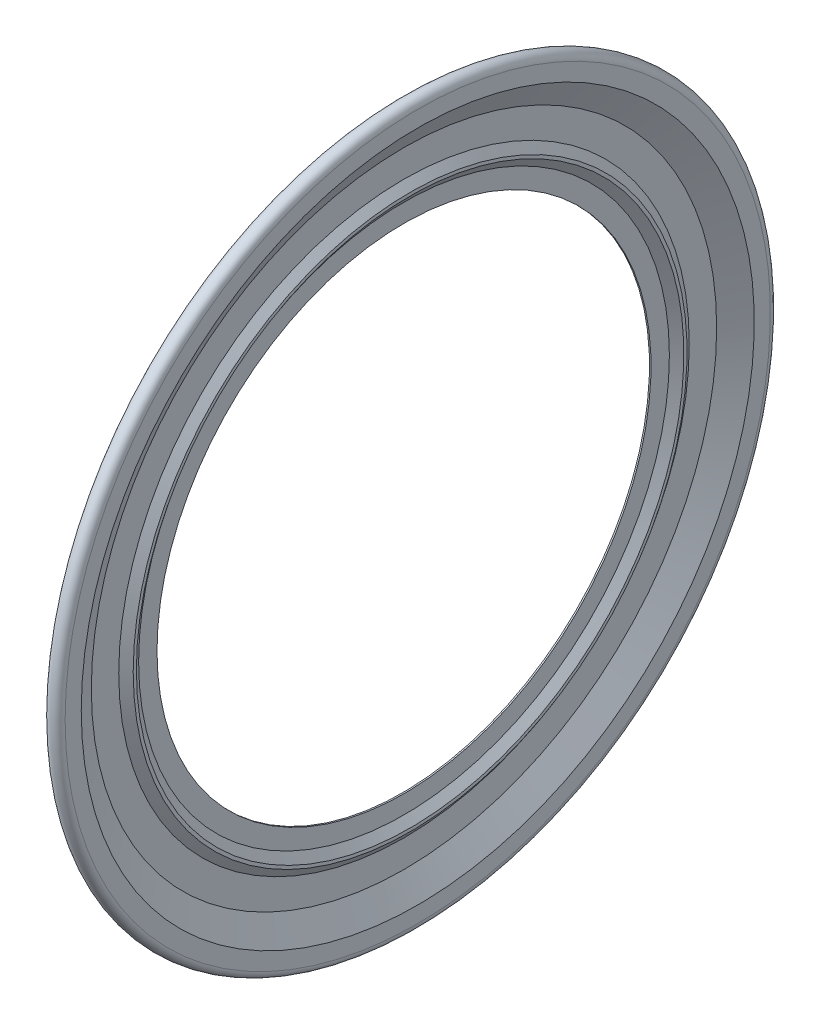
ISO-10303-21;
HEADER;
FILE_DESCRIPTION(('STEP AP214'),'2;1');
FILE_NAME('part.step','',(''),(''),'','','');
FILE_SCHEMA(('AUTOMOTIVE_DESIGN { 1 0 10303 214 1 1 1 1 }'));
ENDSEC;
DATA;
#1=APPLICATION_CONTEXT('core data for automotive mechanical design processes');
#2=APPLICATION_PROTOCOL_DEFINITION('international standard','automotive_design',2000,#1);
#3=PRODUCT_CONTEXT('',#1,'mechanical');
#4=PRODUCT('Part','Part','',(#3));
#5=PRODUCT_RELATED_PRODUCT_CATEGORY('part','',(#4));
#6=PRODUCT_DEFINITION_FORMATION('','',#4);
#7=PRODUCT_DEFINITION_CONTEXT('part definition',#1,'design');
#8=PRODUCT_DEFINITION('design','',#6,#7);
#9=PRODUCT_DEFINITION_SHAPE('','',#8);
#10=(LENGTH_UNIT() NAMED_UNIT(*) SI_UNIT(.MILLI.,.METRE.));
#11=(NAMED_UNIT(*) PLANE_ANGLE_UNIT() SI_UNIT($,.RADIAN.));
#12=(NAMED_UNIT(*) SI_UNIT($,.STERADIAN.) SOLID_ANGLE_UNIT());
#13=UNCERTAINTY_MEASURE_WITH_UNIT(LENGTH_MEASURE(1.E-05),#10,'distance_accuracy_value','');
#14=(GEOMETRIC_REPRESENTATION_CONTEXT(3) GLOBAL_UNCERTAINTY_ASSIGNED_CONTEXT((#13)) GLOBAL_UNIT_ASSIGNED_CONTEXT((#10,
#11,#12)) REPRESENTATION_CONTEXT('',''));
#15=CARTESIAN_POINT('',(0.,0.,0.));
#16=DIRECTION('',(0.,0.,1.));
#17=DIRECTION('',(1.,0.,0.));
#18=AXIS2_PLACEMENT_3D('',#15,#16,#17);
#19=CARTESIAN_POINT('',(0.25,0.,0.));
#20=DIRECTION('',(1.,0.,0.));
#21=DIRECTION('',(0.,0.,-1.));
#22=AXIS2_PLACEMENT_3D('',#19,#20,#21);
#23=CONICAL_SURFACE('',#22,20.4694194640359,1.0471975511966);
#24=CARTESIAN_POINT('',(1.15,0.,0.));
#25=DIRECTION('',(-1.,0.,0.));
#26=DIRECTION('',(0.,0.,1.));
#27=AXIS2_PLACEMENT_3D('',#24,#25,#26);
#28=CIRCLE('',#27,22.028265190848);
#29=CARTESIAN_POINT('',(1.15,0.,22.028265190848));
#30=VERTEX_POINT('',#29);
#31=EDGE_CURVE('E10',#30,#30,#28,.T.);
#32=ORIENTED_EDGE('',*,*,#31,.T.);
#33=EDGE_LOOP('',(#32));
#34=FACE_BOUND('',#33,.T.);
#35=CARTESIAN_POINT('',(0.25,0.,0.));
#36=DIRECTION('',(-1.,0.,0.));
#37=DIRECTION('',(0.,0.,1.));
#38=AXIS2_PLACEMENT_3D('',#35,#36,#37);
#39=CIRCLE('',#38,20.4694194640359);
#40=CARTESIAN_POINT('',(0.25,0.,20.4694194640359));
#41=VERTEX_POINT('',#40);
#42=EDGE_CURVE('E92',#41,#41,#39,.T.);
#43=ORIENTED_EDGE('',*,*,#42,.F.);
#44=EDGE_LOOP('',(#43));
#45=FACE_BOUND('',#44,.T.);
#46=ADVANCED_FACE('F28',(#34,#45),#23,.T.);
#47=CARTESIAN_POINT('',(1.15,22.028265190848,0.));
#48=DIRECTION('',(-1.,0.,0.));
#49=DIRECTION('',(0.,0.,1.));
#50=AXIS2_PLACEMENT_3D('',#47,#48,#49);
#51=PLANE('',#50);
#52=CARTESIAN_POINT('',(1.15,0.,0.));
#53=DIRECTION('',(-1.,0.,0.));
#54=DIRECTION('',(0.,0.,1.));
#55=AXIS2_PLACEMENT_3D('',#52,#53,#54);
#56=CIRCLE('',#55,23.0556622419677);
#57=CARTESIAN_POINT('',(1.15,0.,23.0556622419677));
#58=VERTEX_POINT('',#57);
#59=EDGE_CURVE('E34',#58,#58,#56,.T.);
#60=ORIENTED_EDGE('',*,*,#59,.T.);
#61=EDGE_LOOP('',(#60));
#62=FACE_BOUND('',#61,.T.);
#63=ORIENTED_EDGE('',*,*,#31,.F.);
#64=EDGE_LOOP('',(#63));
#65=FACE_BOUND('',#64,.T.);
#66=ADVANCED_FACE('F100',(#62,#65),#51,.T.);
#67=CARTESIAN_POINT('',(0.75,0.,0.));
#68=DIRECTION('',(-1.,0.,0.));
#69=DIRECTION('',(0.,0.,1.));
#70=AXIS2_PLACEMENT_3D('',#67,#68,#69);
#71=TOROIDAL_SURFACE('',#70,23.0556622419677,0.4);
#72=CARTESIAN_POINT('',(0.35,0.,0.));
#73=DIRECTION('',(-1.,0.,0.));
#74=DIRECTION('',(0.,0.,1.));
#75=AXIS2_PLACEMENT_3D('',#72,#73,#74);
#76=CIRCLE('',#75,23.0556622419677);
#77=CARTESIAN_POINT('',(0.35,0.,23.0556622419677));
#78=VERTEX_POINT('',#77);
#79=EDGE_CURVE('E38',#78,#78,#76,.T.);
#80=ORIENTED_EDGE('',*,*,#79,.T.);
#81=EDGE_LOOP('',(#80));
#82=FACE_BOUND('',#81,.T.);
#83=ORIENTED_EDGE('',*,*,#59,.F.);
#84=EDGE_LOOP('',(#83));
#85=FACE_BOUND('',#84,.T.);
#86=ADVANCED_FACE('F104',(#82,#85),#71,.F.);
#87=CARTESIAN_POINT('',(0.35,23.0556622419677,0.));
#88=DIRECTION('',(1.,0.,0.));
#89=DIRECTION('',(0.,0.,-1.));
#90=AXIS2_PLACEMENT_3D('',#87,#88,#89);
#91=PLANE('',#90);
#92=CARTESIAN_POINT('',(0.35,0.,0.));
#93=DIRECTION('',(-1.,0.,0.));
#94=DIRECTION('',(0.,0.,1.));
#95=AXIS2_PLACEMENT_3D('',#92,#93,#94);
#96=CIRCLE('',#95,21.7039165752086);
#97=CARTESIAN_POINT('',(0.35,0.,21.7039165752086));
#98=VERTEX_POINT('',#97);
#99=EDGE_CURVE('E42',#98,#98,#96,.T.);
#100=ORIENTED_EDGE('',*,*,#99,.T.);
#101=EDGE_LOOP('',(#100));
#102=FACE_BOUND('',#101,.T.);
#103=ORIENTED_EDGE('',*,*,#79,.F.);
#104=EDGE_LOOP('',(#103));
#105=FACE_BOUND('',#104,.T.);
#106=ADVANCED_FACE('F108',(#102,#105),#91,.T.);
#107=CARTESIAN_POINT('',(0.,0.,0.));
#108=DIRECTION('',(-1.,0.,0.));
#109=DIRECTION('',(0.,0.,1.));
#110=AXIS2_PLACEMENT_3D('',#107,#108,#109);
#111=CYLINDRICAL_SURFACE('',#110,21.7039165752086);
#112=ORIENTED_EDGE('',*,*,#99,.F.);
#113=EDGE_LOOP('',(#112));
#114=FACE_BOUND('',#113,.T.);
#115=CARTESIAN_POINT('',(0.25,0.,0.));
#116=DIRECTION('',(-1.,0.,0.));
#117=DIRECTION('',(0.,0.,1.));
#118=AXIS2_PLACEMENT_3D('',#115,#116,#117);
#119=CIRCLE('',#118,21.7039165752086);
#120=CARTESIAN_POINT('',(0.25,0.,21.7039165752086));
#121=VERTEX_POINT('',#120);
#122=EDGE_CURVE('E47',#121,#121,#119,.T.);
#123=ORIENTED_EDGE('',*,*,#122,.T.);
#124=EDGE_LOOP('',(#123));
#125=FACE_BOUND('',#124,.T.);
#126=ADVANCED_FACE('F115',(#114,#125),#111,.F.);
#127=CARTESIAN_POINT('',(0.25,23.0556622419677,0.));
#128=DIRECTION('',(1.,0.,0.));
#129=DIRECTION('',(0.,0.,-1.));
#130=AXIS2_PLACEMENT_3D('',#127,#128,#129);
#131=PLANE('',#130);
#132=ORIENTED_EDGE('',*,*,#122,.F.);
#133=EDGE_LOOP('',(#132));
#134=FACE_BOUND('',#133,.T.);
#135=CARTESIAN_POINT('',(0.25,0.,0.));
#136=DIRECTION('',(-1.,0.,0.));
#137=DIRECTION('',(0.,0.,1.));
#138=AXIS2_PLACEMENT_3D('',#135,#136,#137);
#139=CIRCLE('',#138,23.0556622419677);
#140=CARTESIAN_POINT('',(0.25,0.,23.0556622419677));
#141=VERTEX_POINT('',#140);
#142=EDGE_CURVE('E50',#141,#141,#139,.T.);
#143=ORIENTED_EDGE('',*,*,#142,.T.);
#144=EDGE_LOOP('',(#143));
#145=FACE_BOUND('',#144,.T.);
#146=ADVANCED_FACE('F119',(#134,#145),#131,.F.);
#147=CARTESIAN_POINT('',(0.75,0.,0.));
#148=DIRECTION('',(-1.,0.,0.));
#149=DIRECTION('',(0.,0.,1.));
#150=AXIS2_PLACEMENT_3D('',#147,#148,#149);
#151=TOROIDAL_SURFACE('',#150,23.0556622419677,0.5);
#152=ORIENTED_EDGE('',*,*,#142,.F.);
#153=EDGE_LOOP('',(#152));
#154=FACE_BOUND('',#153,.T.);
#155=CARTESIAN_POINT('',(1.25,0.,0.));
#156=DIRECTION('',(-1.,0.,0.));
#157=DIRECTION('',(0.,0.,1.));
#158=AXIS2_PLACEMENT_3D('',#155,#156,#157);
#159=CIRCLE('',#158,23.0556622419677);
#160=CARTESIAN_POINT('',(1.25,0.,23.0556622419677));
#161=VERTEX_POINT('',#160);
#162=EDGE_CURVE('E53',#161,#161,#159,.T.);
#163=ORIENTED_EDGE('',*,*,#162,.T.);
#164=EDGE_LOOP('',(#163));
#165=FACE_BOUND('',#164,.T.);
#166=ADVANCED_FACE('F123',(#154,#165),#151,.T.);
#167=CARTESIAN_POINT('',(1.25,23.0556622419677,0.));
#168=DIRECTION('',(1.,0.,0.));
#169=DIRECTION('',(0.,0.,-1.));
#170=AXIS2_PLACEMENT_3D('',#167,#168,#169);
#171=PLANE('',#170);
#172=CARTESIAN_POINT('',(1.25,0.,0.));
#173=DIRECTION('',(-1.,0.,0.));
#174=DIRECTION('',(0.,0.,1.));
#175=AXIS2_PLACEMENT_3D('',#172,#173,#174);
#176=CIRCLE('',#175,22.0014702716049);
#177=CARTESIAN_POINT('',(1.25,0.,22.0014702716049));
#178=VERTEX_POINT('',#177);
#179=EDGE_CURVE('E56',#178,#178,#176,.T.);
#180=ORIENTED_EDGE('',*,*,#179,.T.);
#181=EDGE_LOOP('',(#180));
#182=FACE_BOUND('',#181,.T.);
#183=ORIENTED_EDGE('',*,*,#162,.F.);
#184=EDGE_LOOP('',(#183));
#185=FACE_BOUND('',#184,.T.);
#186=ADVANCED_FACE('F127',(#182,#185),#171,.T.);
#187=CARTESIAN_POINT('',(1.25,0.,0.));
#188=DIRECTION('',(1.,0.,0.));
#189=DIRECTION('',(0.,0.,-1.));
#190=AXIS2_PLACEMENT_3D('',#187,#188,#189);
#191=CONICAL_SURFACE('',#190,22.0014702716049,1.0471975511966);
#192=CARTESIAN_POINT('',(0.35,0.,0.));
#193=DIRECTION('',(-1.,0.,0.));
#194=DIRECTION('',(0.,0.,1.));
#195=AXIS2_PLACEMENT_3D('',#192,#193,#194);
#196=CIRCLE('',#195,20.4426245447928);
#197=CARTESIAN_POINT('',(0.35,0.,20.4426245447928));
#198=VERTEX_POINT('',#197);
#199=EDGE_CURVE('E59',#198,#198,#196,.T.);
#200=ORIENTED_EDGE('',*,*,#199,.T.);
#201=EDGE_LOOP('',(#200));
#202=FACE_BOUND('',#201,.T.);
#203=ORIENTED_EDGE('',*,*,#179,.F.);
#204=EDGE_LOOP('',(#203));
#205=FACE_BOUND('',#204,.T.);
#206=ADVANCED_FACE('F131',(#202,#205),#191,.F.);
#207=CARTESIAN_POINT('',(0.35,20.4426245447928,0.));
#208=DIRECTION('',(1.,0.,0.));
#209=DIRECTION('',(0.,0.,-1.));
#210=AXIS2_PLACEMENT_3D('',#207,#208,#209);
#211=PLANE('',#210);
#212=CARTESIAN_POINT('',(0.35,0.,0.));
#213=DIRECTION('',(-1.,0.,0.));
#214=DIRECTION('',(0.,0.,1.));
#215=AXIS2_PLACEMENT_3D('',#212,#213,#214);
#216=CIRCLE('',#215,18.6503967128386);
#217=CARTESIAN_POINT('',(0.35,0.,18.6503967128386));
#218=VERTEX_POINT('',#217);
#219=EDGE_CURVE('E62',#218,#218,#216,.T.);
#220=ORIENTED_EDGE('',*,*,#219,.T.);
#221=EDGE_LOOP('',(#220));
#222=FACE_BOUND('',#221,.T.);
#223=ORIENTED_EDGE('',*,*,#199,.F.);
#224=EDGE_LOOP('',(#223));
#225=FACE_BOUND('',#224,.T.);
#226=ADVANCED_FACE('F135',(#222,#225),#211,.T.);
#227=CARTESIAN_POINT('',(0.35,0.,0.));
#228=DIRECTION('',(-1.,0.,0.));
#229=DIRECTION('',(0.,0.,1.));
#230=AXIS2_PLACEMENT_3D('',#227,#228,#229);
#231=CONICAL_SURFACE('',#230,18.6503967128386,0.938302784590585);
#232=CARTESIAN_POINT('',(0.75,0.,0.));
#233=DIRECTION('',(-1.,0.,0.));
#234=DIRECTION('',(0.,0.,1.));
#235=AXIS2_PLACEMENT_3D('',#232,#233,#234);
#236=CIRCLE('',#235,18.1046500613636);
#237=CARTESIAN_POINT('',(0.75,0.,18.1046500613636));
#238=VERTEX_POINT('',#237);
#239=EDGE_CURVE('E65',#238,#238,#236,.T.);
#240=ORIENTED_EDGE('',*,*,#239,.T.);
#241=EDGE_LOOP('',(#240));
#242=FACE_BOUND('',#241,.T.);
#243=ORIENTED_EDGE('',*,*,#219,.F.);
#244=EDGE_LOOP('',(#243));
#245=FACE_BOUND('',#244,.T.);
#246=ADVANCED_FACE('F139',(#242,#245),#231,.T.);
#247=CARTESIAN_POINT('',(0.75,18.1046500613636,0.));
#248=DIRECTION('',(1.,0.,0.));
#249=DIRECTION('',(0.,0.,-1.));
#250=AXIS2_PLACEMENT_3D('',#247,#248,#249);
#251=PLANE('',#250);
#252=CARTESIAN_POINT('',(0.75,0.,0.));
#253=DIRECTION('',(-1.,0.,0.));
#254=DIRECTION('',(0.,0.,1.));
#255=AXIS2_PLACEMENT_3D('',#252,#253,#254);
#256=CIRCLE('',#255,17.8962004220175);
#257=CARTESIAN_POINT('',(0.75,0.,17.8962004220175));
#258=VERTEX_POINT('',#257);
#259=EDGE_CURVE('E68',#258,#258,#256,.T.);
#260=ORIENTED_EDGE('',*,*,#259,.T.);
#261=EDGE_LOOP('',(#260));
#262=FACE_BOUND('',#261,.T.);
#263=ORIENTED_EDGE('',*,*,#239,.F.);
#264=EDGE_LOOP('',(#263));
#265=FACE_BOUND('',#264,.T.);
#266=ADVANCED_FACE('F143',(#262,#265),#251,.T.);
#267=CARTESIAN_POINT('',(0.75,0.,0.));
#268=DIRECTION('',(1.,0.,0.));
#269=DIRECTION('',(0.,0.,-1.));
#270=AXIS2_PLACEMENT_3D('',#267,#268,#269);
#271=CONICAL_SURFACE('',#270,17.8962004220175,0.938302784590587);
#272=CARTESIAN_POINT('',(0.35,0.,0.));
#273=DIRECTION('',(-1.,0.,0.));
#274=DIRECTION('',(0.,0.,1.));
#275=AXIS2_PLACEMENT_3D('',#272,#273,#274);
#276=CIRCLE('',#275,17.3504537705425);
#277=CARTESIAN_POINT('',(0.35,0.,17.3504537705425));
#278=VERTEX_POINT('',#277);
#279=EDGE_CURVE('E71',#278,#278,#276,.T.);
#280=ORIENTED_EDGE('',*,*,#279,.T.);
#281=EDGE_LOOP('',(#280));
#282=FACE_BOUND('',#281,.T.);
#283=ORIENTED_EDGE('',*,*,#259,.F.);
#284=EDGE_LOOP('',(#283));
#285=FACE_BOUND('',#284,.T.);
#286=ADVANCED_FACE('F147',(#282,#285),#271,.F.);
#287=CARTESIAN_POINT('',(0.35,17.3504537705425,0.));
#288=DIRECTION('',(1.,0.,0.));
#289=DIRECTION('',(0.,0.,-1.));
#290=AXIS2_PLACEMENT_3D('',#287,#288,#289);
#291=PLANE('',#290);
#292=CARTESIAN_POINT('',(0.35,0.,0.));
#293=DIRECTION('',(-1.,0.,0.));
#294=DIRECTION('',(0.,0.,1.));
#295=AXIS2_PLACEMENT_3D('',#292,#293,#294);
#296=CIRCLE('',#295,16.1486795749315);
#297=CARTESIAN_POINT('',(0.35,0.,16.1486795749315));
#298=VERTEX_POINT('',#297);
#299=EDGE_CURVE('E74',#298,#298,#296,.T.);
#300=ORIENTED_EDGE('',*,*,#299,.T.);
#301=EDGE_LOOP('',(#300));
#302=FACE_BOUND('',#301,.T.);
#303=ORIENTED_EDGE('',*,*,#279,.F.);
#304=EDGE_LOOP('',(#303));
#305=FACE_BOUND('',#304,.T.);
#306=ADVANCED_FACE('F151',(#302,#305),#291,.T.);
#307=CARTESIAN_POINT('',(0.,0.,0.));
#308=DIRECTION('',(-1.,0.,0.));
#309=DIRECTION('',(0.,0.,1.));
#310=AXIS2_PLACEMENT_3D('',#307,#308,#309);
#311=CYLINDRICAL_SURFACE('',#310,16.1486795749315);
#312=CARTESIAN_POINT('',(0.25,0.,0.));
#313=DIRECTION('',(-1.,0.,0.));
#314=DIRECTION('',(0.,0.,1.));
#315=AXIS2_PLACEMENT_3D('',#312,#313,#314);
#316=CIRCLE('',#315,16.1486795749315);
#317=CARTESIAN_POINT('',(0.25,0.,16.1486795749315));
#318=VERTEX_POINT('',#317);
#319=EDGE_CURVE('E77',#318,#318,#316,.T.);
#320=ORIENTED_EDGE('',*,*,#319,.T.);
#321=EDGE_LOOP('',(#320));
#322=FACE_BOUND('',#321,.T.);
#323=ORIENTED_EDGE('',*,*,#299,.F.);
#324=EDGE_LOOP('',(#323));
#325=FACE_BOUND('',#324,.T.);
#326=ADVANCED_FACE('F155',(#322,#325),#311,.F.);
#327=CARTESIAN_POINT('',(0.25,16.1486795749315,0.));
#328=DIRECTION('',(-1.,0.,0.));
#329=DIRECTION('',(0.,0.,1.));
#330=AXIS2_PLACEMENT_3D('',#327,#328,#329);
#331=PLANE('',#330);
#332=CARTESIAN_POINT('',(0.25,0.,0.));
#333=DIRECTION('',(-1.,0.,0.));
#334=DIRECTION('',(0.,0.,1.));
#335=AXIS2_PLACEMENT_3D('',#332,#333,#334);
#336=CIRCLE('',#335,17.3831766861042);
#337=CARTESIAN_POINT('',(0.25,0.,17.3831766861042));
#338=VERTEX_POINT('',#337);
#339=EDGE_CURVE('E80',#338,#338,#336,.T.);
#340=ORIENTED_EDGE('',*,*,#339,.T.);
#341=EDGE_LOOP('',(#340));
#342=FACE_BOUND('',#341,.T.);
#343=ORIENTED_EDGE('',*,*,#319,.F.);
#344=EDGE_LOOP('',(#343));
#345=FACE_BOUND('',#344,.T.);
#346=ADVANCED_FACE('F159',(#342,#345),#331,.T.);
#347=CARTESIAN_POINT('',(0.25,0.,0.));
#348=DIRECTION('',(1.,0.,0.));
#349=DIRECTION('',(0.,0.,-1.));
#350=AXIS2_PLACEMENT_3D('',#347,#348,#349);
#351=CONICAL_SURFACE('',#350,17.3831766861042,0.938302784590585);
#352=CARTESIAN_POINT('',(0.65,0.,0.));
#353=DIRECTION('',(-1.,0.,0.));
#354=DIRECTION('',(0.,0.,1.));
#355=AXIS2_PLACEMENT_3D('',#352,#353,#354);
#356=CIRCLE('',#355,17.9289233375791);
#357=CARTESIAN_POINT('',(0.65,0.,17.9289233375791));
#358=VERTEX_POINT('',#357);
#359=EDGE_CURVE('E83',#358,#358,#356,.T.);
#360=ORIENTED_EDGE('',*,*,#359,.T.);
#361=EDGE_LOOP('',(#360));
#362=FACE_BOUND('',#361,.T.);
#363=ORIENTED_EDGE('',*,*,#339,.F.);
#364=EDGE_LOOP('',(#363));
#365=FACE_BOUND('',#364,.T.);
#366=ADVANCED_FACE('F163',(#362,#365),#351,.T.);
#367=CARTESIAN_POINT('',(0.65,17.9289233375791,0.));
#368=DIRECTION('',(-1.,0.,0.));
#369=DIRECTION('',(0.,0.,1.));
#370=AXIS2_PLACEMENT_3D('',#367,#368,#369);
#371=PLANE('',#370);
#372=CARTESIAN_POINT('',(0.65,0.,0.));
#373=DIRECTION('',(-1.,0.,0.));
#374=DIRECTION('',(0.,0.,1.));
#375=AXIS2_PLACEMENT_3D('',#372,#373,#374);
#376=CIRCLE('',#375,18.071927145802);
#377=CARTESIAN_POINT('',(0.65,0.,18.071927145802));
#378=VERTEX_POINT('',#377);
#379=EDGE_CURVE('E86',#378,#378,#376,.T.);
#380=ORIENTED_EDGE('',*,*,#379,.T.);
#381=EDGE_LOOP('',(#380));
#382=FACE_BOUND('',#381,.T.);
#383=ORIENTED_EDGE('',*,*,#359,.F.);
#384=EDGE_LOOP('',(#383));
#385=FACE_BOUND('',#384,.T.);
#386=ADVANCED_FACE('F167',(#382,#385),#371,.T.);
#387=CARTESIAN_POINT('',(0.65,0.,0.));
#388=DIRECTION('',(-1.,0.,0.));
#389=DIRECTION('',(0.,0.,1.));
#390=AXIS2_PLACEMENT_3D('',#387,#388,#389);
#391=CONICAL_SURFACE('',#390,18.071927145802,0.938302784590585);
#392=CARTESIAN_POINT('',(0.25,0.,0.));
#393=DIRECTION('',(-1.,0.,0.));
#394=DIRECTION('',(0.,0.,1.));
#395=AXIS2_PLACEMENT_3D('',#392,#393,#394);
#396=CIRCLE('',#395,18.6176737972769);
#397=CARTESIAN_POINT('',(0.25,0.,18.6176737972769));
#398=VERTEX_POINT('',#397);
#399=EDGE_CURVE('E89',#398,#398,#396,.T.);
#400=ORIENTED_EDGE('',*,*,#399,.T.);
#401=EDGE_LOOP('',(#400));
#402=FACE_BOUND('',#401,.T.);
#403=ORIENTED_EDGE('',*,*,#379,.F.);
#404=EDGE_LOOP('',(#403));
#405=FACE_BOUND('',#404,.T.);
#406=ADVANCED_FACE('F171',(#402,#405),#391,.F.);
#407=CARTESIAN_POINT('',(0.25,18.6176737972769,0.));
#408=DIRECTION('',(-1.,0.,0.));
#409=DIRECTION('',(0.,0.,1.));
#410=AXIS2_PLACEMENT_3D('',#407,#408,#409);
#411=PLANE('',#410);
#412=ORIENTED_EDGE('',*,*,#42,.T.);
#413=EDGE_LOOP('',(#412));
#414=FACE_BOUND('',#413,.T.);
#415=ORIENTED_EDGE('',*,*,#399,.F.);
#416=EDGE_LOOP('',(#415));
#417=FACE_BOUND('',#416,.T.);
#418=ADVANCED_FACE('F96',(#414,#417),#411,.T.);
#419=CLOSED_SHELL('',(#46,#66,#86,#106,#126,#146,#166,#186,#206,#226,#246,#266,#286,#306,#326,
#346,#366,#386,#406,#418));
#420=MANIFOLD_SOLID_BREP('B2',#419);
#421=ADVANCED_BREP_SHAPE_REPRESENTATION('',(#18,#420),#14);
#422=SHAPE_DEFINITION_REPRESENTATION(#9,#421);
ENDSEC;
END-ISO-10303-21;
